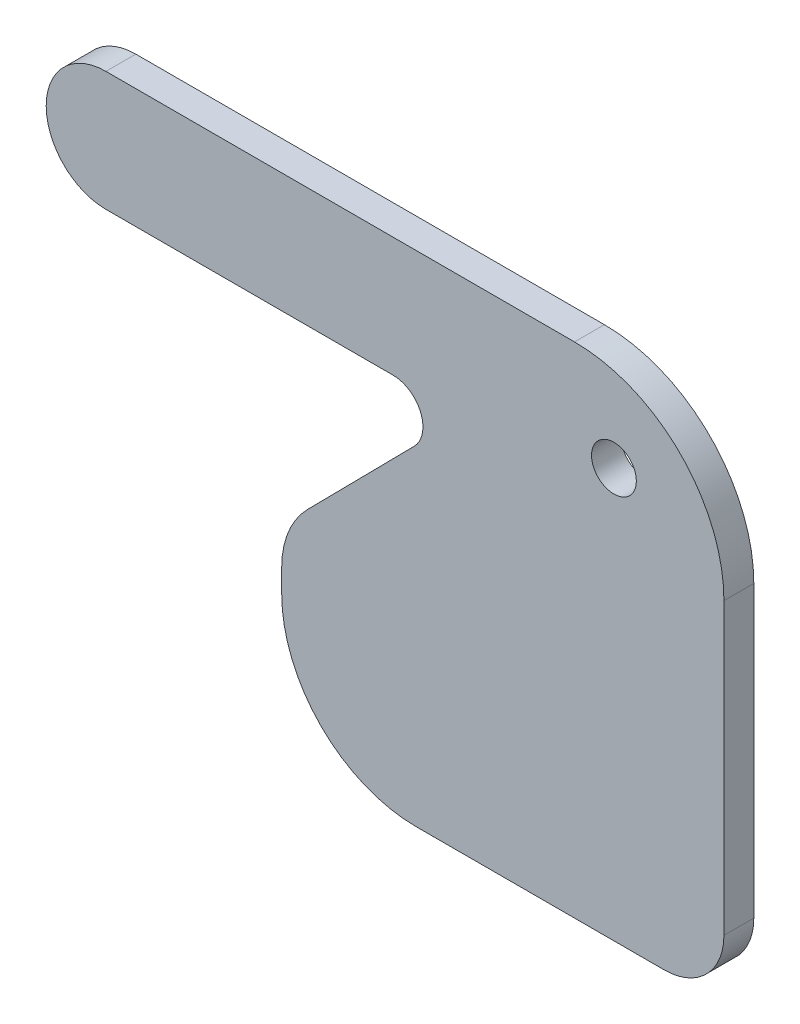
ISO-10303-21;
HEADER;
FILE_DESCRIPTION(('STEP AP214'),'2;1');
FILE_NAME('part.step','',(''),(''),'','','');
FILE_SCHEMA(('AUTOMOTIVE_DESIGN { 1 0 10303 214 1 1 1 1 }'));
ENDSEC;
DATA;
#1=APPLICATION_CONTEXT('core data for automotive mechanical design processes');
#2=APPLICATION_PROTOCOL_DEFINITION('international standard','automotive_design',2000,#1);
#3=PRODUCT_CONTEXT('',#1,'mechanical');
#4=PRODUCT('Part','Part','',(#3));
#5=PRODUCT_RELATED_PRODUCT_CATEGORY('part','',(#4));
#6=PRODUCT_DEFINITION_FORMATION('','',#4);
#7=PRODUCT_DEFINITION_CONTEXT('part definition',#1,'design');
#8=PRODUCT_DEFINITION('design','',#6,#7);
#9=PRODUCT_DEFINITION_SHAPE('','',#8);
#10=(LENGTH_UNIT() NAMED_UNIT(*) SI_UNIT(.MILLI.,.METRE.));
#11=(NAMED_UNIT(*) PLANE_ANGLE_UNIT() SI_UNIT($,.RADIAN.));
#12=(NAMED_UNIT(*) SI_UNIT($,.STERADIAN.) SOLID_ANGLE_UNIT());
#13=UNCERTAINTY_MEASURE_WITH_UNIT(LENGTH_MEASURE(1.E-05),#10,'distance_accuracy_value','');
#14=(GEOMETRIC_REPRESENTATION_CONTEXT(3) GLOBAL_UNCERTAINTY_ASSIGNED_CONTEXT((#13)) GLOBAL_UNIT_ASSIGNED_CONTEXT((#10,
#11,#12)) REPRESENTATION_CONTEXT('',''));
#15=CARTESIAN_POINT('',(0.,0.,0.));
#16=DIRECTION('',(0.,0.,1.));
#17=DIRECTION('',(1.,0.,0.));
#18=AXIS2_PLACEMENT_3D('',#15,#16,#17);
#19=CARTESIAN_POINT('',(-13.1838969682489,-20.,-10.));
#20=DIRECTION('',(0.,0.,1.));
#21=DIRECTION('',(1.,0.,0.));
#22=AXIS2_PLACEMENT_3D('',#19,#20,#21);
#23=CYLINDRICAL_SURFACE('',#22,50.);
#24=CARTESIAN_POINT('',(-13.1838969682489,-20.,0.));
#25=DIRECTION('',(0.,0.,-1.));
#26=DIRECTION('',(-1.,0.,0.));
#27=AXIS2_PLACEMENT_3D('',#24,#25,#26);
#28=CIRCLE('',#27,50.);
#29=CARTESIAN_POINT('',(-13.1838969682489,30.,0.));
#30=VERTEX_POINT('',#29);
#31=CARTESIAN_POINT('',(36.8161030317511,-20.,0.));
#32=VERTEX_POINT('',#31);
#33=EDGE_CURVE('E161',#30,#32,#28,.T.);
#34=ORIENTED_EDGE('',*,*,#33,.T.);
#35=DIRECTION('',(0.,0.,1.));
#36=VECTOR('',#35,1.);
#37=CARTESIAN_POINT('',(36.8161030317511,-20.,-10.));
#38=LINE('',#37,#36);
#39=CARTESIAN_POINT('',(36.8161030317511,-20.,-10.));
#40=VERTEX_POINT('',#39);
#41=EDGE_CURVE('E139',#40,#32,#38,.T.);
#42=ORIENTED_EDGE('',*,*,#41,.F.);
#43=CARTESIAN_POINT('',(-13.1838969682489,-20.,-10.));
#44=DIRECTION('',(0.,0.,-1.));
#45=DIRECTION('',(-1.,0.,0.));
#46=AXIS2_PLACEMENT_3D('',#43,#44,#45);
#47=CIRCLE('',#46,50.);
#48=CARTESIAN_POINT('',(-13.1838969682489,30.,-10.));
#49=VERTEX_POINT('',#48);
#50=EDGE_CURVE('E147',#49,#40,#47,.T.);
#51=ORIENTED_EDGE('',*,*,#50,.F.);
#52=DIRECTION('',(0.,0.,1.));
#53=VECTOR('',#52,1.);
#54=CARTESIAN_POINT('',(-13.1838969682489,30.,-10.));
#55=LINE('',#54,#53);
#56=EDGE_CURVE('E201',#49,#30,#55,.T.);
#57=ORIENTED_EDGE('',*,*,#56,.T.);
#58=EDGE_LOOP('',(#34,#42,#51,#57));
#59=FACE_BOUND('',#58,.T.);
#60=ADVANCED_FACE('F44',(#59),#23,.T.);
#61=CARTESIAN_POINT('',(36.8161030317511,-20.,-10.));
#62=DIRECTION('',(-1.,0.,0.));
#63=DIRECTION('',(0.,-1.,0.));
#64=AXIS2_PLACEMENT_3D('',#61,#62,#63);
#65=PLANE('',#64);
#66=DIRECTION('',(0.,-1.,0.));
#67=VECTOR('',#66,1.);
#68=CARTESIAN_POINT('',(36.8161030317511,-20.,0.));
#69=LINE('',#68,#67);
#70=CARTESIAN_POINT('',(36.8161030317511,-117.,0.));
#71=VERTEX_POINT('',#70);
#72=EDGE_CURVE('E236',#32,#71,#69,.T.);
#73=ORIENTED_EDGE('',*,*,#72,.T.);
#74=DIRECTION('',(0.,0.,1.));
#75=VECTOR('',#74,1.);
#76=CARTESIAN_POINT('',(36.8161030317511,-117.,-10.));
#77=LINE('',#76,#75);
#78=CARTESIAN_POINT('',(36.8161030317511,-117.,-10.));
#79=VERTEX_POINT('',#78);
#80=EDGE_CURVE('E141',#79,#71,#77,.T.);
#81=ORIENTED_EDGE('',*,*,#80,.F.);
#82=DIRECTION('',(0.,-1.,0.));
#83=VECTOR('',#82,1.);
#84=CARTESIAN_POINT('',(36.8161030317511,-20.,-10.));
#85=LINE('',#84,#83);
#86=EDGE_CURVE('E134',#40,#79,#85,.T.);
#87=ORIENTED_EDGE('',*,*,#86,.F.);
#88=ORIENTED_EDGE('',*,*,#41,.T.);
#89=EDGE_LOOP('',(#73,#81,#87,#88));
#90=FACE_BOUND('',#89,.T.);
#91=ADVANCED_FACE('F137',(#90),#65,.F.);
#92=CARTESIAN_POINT('',(16.8161030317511,-117.,-10.));
#93=DIRECTION('',(0.,0.,1.));
#94=DIRECTION('',(1.,0.,0.));
#95=AXIS2_PLACEMENT_3D('',#92,#93,#94);
#96=CYLINDRICAL_SURFACE('',#95,20.);
#97=CARTESIAN_POINT('',(16.8161030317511,-117.,0.));
#98=DIRECTION('',(0.,0.,1.));
#99=DIRECTION('',(1.,0.,0.));
#100=AXIS2_PLACEMENT_3D('',#97,#98,#99);
#101=CIRCLE('',#100,20.);
#102=CARTESIAN_POINT('',(16.8161030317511,-137.,0.));
#103=VERTEX_POINT('',#102);
#104=EDGE_CURVE('E232',#103,#71,#101,.T.);
#105=ORIENTED_EDGE('',*,*,#104,.F.);
#106=DIRECTION('',(0.,0.,1.));
#107=VECTOR('',#106,1.);
#108=CARTESIAN_POINT('',(16.8161030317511,-137.,-10.));
#109=LINE('',#108,#107);
#110=CARTESIAN_POINT('',(16.8161030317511,-137.,-10.));
#111=VERTEX_POINT('',#110);
#112=EDGE_CURVE('E170',#111,#103,#109,.T.);
#113=ORIENTED_EDGE('',*,*,#112,.F.);
#114=CARTESIAN_POINT('',(16.8161030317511,-117.,-10.));
#115=DIRECTION('',(0.,0.,1.));
#116=DIRECTION('',(1.,0.,0.));
#117=AXIS2_PLACEMENT_3D('',#114,#115,#116);
#118=CIRCLE('',#117,20.);
#119=EDGE_CURVE('E146',#111,#79,#118,.T.);
#120=ORIENTED_EDGE('',*,*,#119,.T.);
#121=ORIENTED_EDGE('',*,*,#80,.T.);
#122=EDGE_LOOP('',(#105,#113,#120,#121));
#123=FACE_BOUND('',#122,.T.);
#124=ADVANCED_FACE('F309',(#123),#96,.T.);
#125=CARTESIAN_POINT('',(16.8161030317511,-137.,-10.));
#126=DIRECTION('',(0.,1.,0.));
#127=DIRECTION('',(0.,0.,1.));
#128=AXIS2_PLACEMENT_3D('',#125,#126,#127);
#129=PLANE('',#128);
#130=DIRECTION('',(-1.,0.,0.));
#131=VECTOR('',#130,1.);
#132=CARTESIAN_POINT('',(16.8161030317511,-137.,0.));
#133=LINE('',#132,#131);
#134=CARTESIAN_POINT('',(-66.1838969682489,-137.,0.));
#135=VERTEX_POINT('',#134);
#136=EDGE_CURVE('E229',#103,#135,#133,.T.);
#137=ORIENTED_EDGE('',*,*,#136,.T.);
#138=DIRECTION('',(0.,0.,1.));
#139=VECTOR('',#138,1.);
#140=CARTESIAN_POINT('',(-66.1838969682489,-137.,-10.));
#141=LINE('',#140,#139);
#142=CARTESIAN_POINT('',(-66.1838969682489,-137.,-10.));
#143=VERTEX_POINT('',#142);
#144=EDGE_CURVE('E53',#135,#143,#141,.F.);
#145=ORIENTED_EDGE('',*,*,#144,.T.);
#146=DIRECTION('',(-1.,0.,0.));
#147=VECTOR('',#146,1.);
#148=CARTESIAN_POINT('',(16.8161030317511,-137.,-10.));
#149=LINE('',#148,#147);
#150=EDGE_CURVE('E265',#111,#143,#149,.T.);
#151=ORIENTED_EDGE('',*,*,#150,.F.);
#152=ORIENTED_EDGE('',*,*,#112,.T.);
#153=EDGE_LOOP('',(#137,#145,#151,#152));
#154=FACE_BOUND('',#153,.T.);
#155=ADVANCED_FACE('F314',(#154),#129,.F.);
#156=CARTESIAN_POINT('',(-111.183896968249,-137.,-10.));
#157=DIRECTION('',(1.,0.,0.));
#158=DIRECTION('',(0.,1.,0.));
#159=AXIS2_PLACEMENT_3D('',#156,#157,#158);
#160=PLANE('',#159);
#161=DIRECTION('',(0.,1.,0.));
#162=VECTOR('',#161,1.);
#163=CARTESIAN_POINT('',(-111.183896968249,-137.,-10.));
#164=LINE('',#163,#162);
#165=CARTESIAN_POINT('',(-111.183896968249,-92.,-10.));
#166=VERTEX_POINT('',#165);
#167=CARTESIAN_POINT('',(-111.183896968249,-84.3101412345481,-10.));
#168=VERTEX_POINT('',#167);
#169=EDGE_CURVE('E262',#166,#168,#164,.T.);
#170=ORIENTED_EDGE('',*,*,#169,.F.);
#171=DIRECTION('',(0.,0.,1.));
#172=VECTOR('',#171,1.);
#173=CARTESIAN_POINT('',(-111.183896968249,-92.,-10.));
#174=LINE('',#173,#172);
#175=CARTESIAN_POINT('',(-111.183896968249,-92.,0.));
#176=VERTEX_POINT('',#175);
#177=EDGE_CURVE('E163',#166,#176,#174,.T.);
#178=ORIENTED_EDGE('',*,*,#177,.T.);
#179=DIRECTION('',(0.,1.,0.));
#180=VECTOR('',#179,1.);
#181=CARTESIAN_POINT('',(-111.183896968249,-137.,0.));
#182=LINE('',#181,#180);
#183=CARTESIAN_POINT('',(-111.183896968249,-84.3101412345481,0.));
#184=VERTEX_POINT('',#183);
#185=EDGE_CURVE('E226',#176,#184,#182,.T.);
#186=ORIENTED_EDGE('',*,*,#185,.T.);
#187=DIRECTION('',(0.,0.,1.));
#188=VECTOR('',#187,1.);
#189=CARTESIAN_POINT('',(-111.183896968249,-84.3101412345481,-10.));
#190=LINE('',#189,#188);
#191=EDGE_CURVE('E182',#168,#184,#190,.T.);
#192=ORIENTED_EDGE('',*,*,#191,.F.);
#193=EDGE_LOOP('',(#170,#178,#186,#192));
#194=FACE_BOUND('',#193,.T.);
#195=ADVANCED_FACE('F293',(#194),#160,.F.);
#196=CARTESIAN_POINT('',(-81.1838969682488,-84.3101412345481,-10.));
#197=DIRECTION('',(0.,0.,1.));
#198=DIRECTION('',(1.,0.,0.));
#199=AXIS2_PLACEMENT_3D('',#196,#197,#198);
#200=CYLINDRICAL_SURFACE('',#199,30.);
#201=CARTESIAN_POINT('',(-81.1838969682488,-84.3101412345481,0.));
#202=DIRECTION('',(0.,0.,-1.));
#203=DIRECTION('',(-1.,0.,0.));
#204=AXIS2_PLACEMENT_3D('',#201,#202,#203);
#205=CIRCLE('',#204,30.);
#206=CARTESIAN_POINT('',(-102.537170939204,-63.2379393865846,0.));
#207=VERTEX_POINT('',#206);
#208=EDGE_CURVE('E222',#184,#207,#205,.T.);
#209=ORIENTED_EDGE('',*,*,#208,.T.);
#210=DIRECTION('',(0.,0.,1.));
#211=VECTOR('',#210,1.);
#212=CARTESIAN_POINT('',(-102.537170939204,-63.2379393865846,-10.));
#213=LINE('',#212,#211);
#214=CARTESIAN_POINT('',(-102.537170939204,-63.2379393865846,-10.));
#215=VERTEX_POINT('',#214);
#216=EDGE_CURVE('E186',#215,#207,#213,.T.);
#217=ORIENTED_EDGE('',*,*,#216,.F.);
#218=CARTESIAN_POINT('',(-81.1838969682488,-84.3101412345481,-10.));
#219=DIRECTION('',(0.,0.,-1.));
#220=DIRECTION('',(-1.,0.,0.));
#221=AXIS2_PLACEMENT_3D('',#218,#219,#220);
#222=CIRCLE('',#221,30.);
#223=EDGE_CURVE('E259',#168,#215,#222,.T.);
#224=ORIENTED_EDGE('',*,*,#223,.F.);
#225=ORIENTED_EDGE('',*,*,#191,.T.);
#226=EDGE_LOOP('',(#209,#217,#224,#225));
#227=FACE_BOUND('',#226,.T.);
#228=ADVANCED_FACE('F297',(#227),#200,.T.);
#229=CARTESIAN_POINT('',(-66.7999803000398,-27.0240672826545,-10.));
#230=DIRECTION('',(-0.711775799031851,0.702406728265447,0.));
#231=DIRECTION('',(-0.702406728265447,-0.711775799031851,0.));
#232=AXIS2_PLACEMENT_3D('',#229,#230,#231);
#233=PLANE('',#232);
#234=DIRECTION('',(-0.702406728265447,-0.711775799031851,0.));
#235=VECTOR('',#234,1.);
#236=CARTESIAN_POINT('',(-66.7999803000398,-27.0240672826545,0.));
#237=LINE('',#236,#235);
#238=CARTESIAN_POINT('',(-66.7999803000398,-27.0240672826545,0.));
#239=VERTEX_POINT('',#238);
#240=EDGE_CURVE('E218',#239,#207,#237,.T.);
#241=ORIENTED_EDGE('',*,*,#240,.F.);
#242=DIRECTION('',(0.,0.,1.));
#243=VECTOR('',#242,1.);
#244=CARTESIAN_POINT('',(-66.7999803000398,-27.0240672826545,-10.));
#245=LINE('',#244,#243);
#246=CARTESIAN_POINT('',(-66.7999803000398,-27.0240672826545,-10.));
#247=VERTEX_POINT('',#246);
#248=EDGE_CURVE('E189',#247,#239,#245,.T.);
#249=ORIENTED_EDGE('',*,*,#248,.F.);
#250=DIRECTION('',(-0.702406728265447,-0.711775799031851,0.));
#251=VECTOR('',#250,1.);
#252=CARTESIAN_POINT('',(-66.7999803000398,-27.0240672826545,-10.));
#253=LINE('',#252,#251);
#254=EDGE_CURVE('E255',#247,#215,#253,.T.);
#255=ORIENTED_EDGE('',*,*,#254,.T.);
#256=ORIENTED_EDGE('',*,*,#216,.T.);
#257=EDGE_LOOP('',(#241,#249,#255,#256));
#258=FACE_BOUND('',#257,.T.);
#259=ADVANCED_FACE('F322',(#258),#233,.T.);
#260=CARTESIAN_POINT('',(-73.9177382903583,-20.,-10.));
#261=DIRECTION('',(0.,0.,1.));
#262=DIRECTION('',(1.,0.,0.));
#263=AXIS2_PLACEMENT_3D('',#260,#261,#262);
#264=CYLINDRICAL_SURFACE('',#263,9.99999999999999);
#265=CARTESIAN_POINT('',(-73.9177382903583,-20.,0.));
#266=DIRECTION('',(0.,0.,1.));
#267=DIRECTION('',(1.,0.,0.));
#268=AXIS2_PLACEMENT_3D('',#265,#266,#267);
#269=CIRCLE('',#268,9.99999999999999);
#270=CARTESIAN_POINT('',(-73.9177382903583,-10.,0.));
#271=VERTEX_POINT('',#270);
#272=EDGE_CURVE('E214',#239,#271,#269,.T.);
#273=ORIENTED_EDGE('',*,*,#272,.T.);
#274=DIRECTION('',(0.,0.,1.));
#275=VECTOR('',#274,1.);
#276=CARTESIAN_POINT('',(-73.9177382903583,-10.,-10.));
#277=LINE('',#276,#275);
#278=CARTESIAN_POINT('',(-73.9177382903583,-10.,-10.));
#279=VERTEX_POINT('',#278);
#280=EDGE_CURVE('E192',#279,#271,#277,.T.);
#281=ORIENTED_EDGE('',*,*,#280,.F.);
#282=CARTESIAN_POINT('',(-73.9177382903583,-20.,-10.));
#283=DIRECTION('',(0.,0.,1.));
#284=DIRECTION('',(1.,0.,0.));
#285=AXIS2_PLACEMENT_3D('',#282,#283,#284);
#286=CIRCLE('',#285,9.99999999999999);
#287=EDGE_CURVE('E252',#247,#279,#286,.T.);
#288=ORIENTED_EDGE('',*,*,#287,.F.);
#289=ORIENTED_EDGE('',*,*,#248,.T.);
#290=EDGE_LOOP('',(#273,#281,#288,#289));
#291=FACE_BOUND('',#290,.T.);
#292=ADVANCED_FACE('F325',(#291),#264,.F.);
#293=CARTESIAN_POINT('',(-170.,-10.,-10.));
#294=DIRECTION('',(0.,-1.,0.));
#295=DIRECTION('',(1.,0.,0.));
#296=AXIS2_PLACEMENT_3D('',#293,#294,#295);
#297=PLANE('',#296);
#298=DIRECTION('',(1.,0.,0.));
#299=VECTOR('',#298,1.);
#300=CARTESIAN_POINT('',(-170.,-10.,0.));
#301=LINE('',#300,#299);
#302=CARTESIAN_POINT('',(-170.,-10.,0.));
#303=VERTEX_POINT('',#302);
#304=EDGE_CURVE('E210',#303,#271,#301,.T.);
#305=ORIENTED_EDGE('',*,*,#304,.F.);
#306=DIRECTION('',(0.,0.,1.));
#307=VECTOR('',#306,1.);
#308=CARTESIAN_POINT('',(-170.,-10.,-10.));
#309=LINE('',#308,#307);
#310=CARTESIAN_POINT('',(-170.,-10.,-10.));
#311=VERTEX_POINT('',#310);
#312=EDGE_CURVE('E195',#311,#303,#309,.T.);
#313=ORIENTED_EDGE('',*,*,#312,.F.);
#314=DIRECTION('',(1.,0.,0.));
#315=VECTOR('',#314,1.);
#316=CARTESIAN_POINT('',(-170.,-10.,-10.));
#317=LINE('',#316,#315);
#318=EDGE_CURVE('E248',#311,#279,#317,.T.);
#319=ORIENTED_EDGE('',*,*,#318,.T.);
#320=ORIENTED_EDGE('',*,*,#280,.T.);
#321=EDGE_LOOP('',(#305,#313,#319,#320));
#322=FACE_BOUND('',#321,.T.);
#323=ADVANCED_FACE('F329',(#322),#297,.T.);
#324=CARTESIAN_POINT('',(-170.,10.,-10.));
#325=DIRECTION('',(0.,0.,1.));
#326=DIRECTION('',(1.,0.,0.));
#327=AXIS2_PLACEMENT_3D('',#324,#325,#326);
#328=CYLINDRICAL_SURFACE('',#327,20.);
#329=CARTESIAN_POINT('',(-170.,10.,0.));
#330=DIRECTION('',(0.,0.,1.));
#331=DIRECTION('',(1.,0.,0.));
#332=AXIS2_PLACEMENT_3D('',#329,#330,#331);
#333=CIRCLE('',#332,20.);
#334=CARTESIAN_POINT('',(-170.,30.,0.));
#335=VERTEX_POINT('',#334);
#336=EDGE_CURVE('E206',#335,#303,#333,.T.);
#337=ORIENTED_EDGE('',*,*,#336,.F.);
#338=DIRECTION('',(0.,0.,1.));
#339=VECTOR('',#338,1.);
#340=CARTESIAN_POINT('',(-170.,30.,-10.));
#341=LINE('',#340,#339);
#342=CARTESIAN_POINT('',(-170.,30.,-10.));
#343=VERTEX_POINT('',#342);
#344=EDGE_CURVE('E198',#343,#335,#341,.T.);
#345=ORIENTED_EDGE('',*,*,#344,.F.);
#346=CARTESIAN_POINT('',(-170.,10.,-10.));
#347=DIRECTION('',(0.,0.,1.));
#348=DIRECTION('',(1.,0.,0.));
#349=AXIS2_PLACEMENT_3D('',#346,#347,#348);
#350=CIRCLE('',#349,20.);
#351=EDGE_CURVE('E244',#343,#311,#350,.T.);
#352=ORIENTED_EDGE('',*,*,#351,.T.);
#353=ORIENTED_EDGE('',*,*,#312,.T.);
#354=EDGE_LOOP('',(#337,#345,#352,#353));
#355=FACE_BOUND('',#354,.T.);
#356=ADVANCED_FACE('F333',(#355),#328,.T.);
#357=CARTESIAN_POINT('',(-170.,30.,-10.));
#358=DIRECTION('',(0.,-1.,0.));
#359=DIRECTION('',(0.,0.,-1.));
#360=AXIS2_PLACEMENT_3D('',#357,#358,#359);
#361=PLANE('',#360);
#362=DIRECTION('',(1.,0.,0.));
#363=VECTOR('',#362,1.);
#364=CARTESIAN_POINT('',(-170.,30.,0.));
#365=LINE('',#364,#363);
#366=EDGE_CURVE('E158',#335,#30,#365,.T.);
#367=ORIENTED_EDGE('',*,*,#366,.T.);
#368=ORIENTED_EDGE('',*,*,#56,.F.);
#369=DIRECTION('',(1.,0.,0.));
#370=VECTOR('',#369,1.);
#371=CARTESIAN_POINT('',(-170.,30.,-10.));
#372=LINE('',#371,#370);
#373=EDGE_CURVE('E153',#343,#49,#372,.T.);
#374=ORIENTED_EDGE('',*,*,#373,.F.);
#375=ORIENTED_EDGE('',*,*,#344,.T.);
#376=EDGE_LOOP('',(#367,#368,#374,#375));
#377=FACE_BOUND('',#376,.T.);
#378=ADVANCED_FACE('F337',(#377),#361,.F.);
#379=CARTESIAN_POINT('',(-13.1838969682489,-20.,-10.));
#380=DIRECTION('',(0.,0.,-1.));
#381=DIRECTION('',(-1.,0.,0.));
#382=AXIS2_PLACEMENT_3D('',#379,#380,#381);
#383=PLANE('',#382);
#384=CARTESIAN_POINT('',(0.,0.,-10.));
#385=DIRECTION('',(0.,0.,1.));
#386=DIRECTION('',(1.,0.,0.));
#387=AXIS2_PLACEMENT_3D('',#384,#385,#386);
#388=CIRCLE('',#387,7.5);
#389=CARTESIAN_POINT('',(7.5,0.,-10.));
#390=VERTEX_POINT('',#389);
#391=EDGE_CURVE('E241',#390,#390,#388,.T.);
#392=ORIENTED_EDGE('',*,*,#391,.T.);
#393=EDGE_LOOP('',(#392));
#394=FACE_BOUND('',#393,.T.);
#395=ORIENTED_EDGE('',*,*,#150,.T.);
#396=CARTESIAN_POINT('',(-66.1838969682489,-92.,-10.));
#397=DIRECTION('',(0.,0.,-1.));
#398=DIRECTION('',(-1.,0.,0.));
#399=AXIS2_PLACEMENT_3D('',#396,#397,#398);
#400=CIRCLE('',#399,45.);
#401=EDGE_CURVE('E11',#143,#166,#400,.T.);
#402=ORIENTED_EDGE('',*,*,#401,.T.);
#403=ORIENTED_EDGE('',*,*,#169,.T.);
#404=ORIENTED_EDGE('',*,*,#223,.T.);
#405=ORIENTED_EDGE('',*,*,#254,.F.);
#406=ORIENTED_EDGE('',*,*,#287,.T.);
#407=ORIENTED_EDGE('',*,*,#318,.F.);
#408=ORIENTED_EDGE('',*,*,#351,.F.);
#409=ORIENTED_EDGE('',*,*,#373,.T.);
#410=ORIENTED_EDGE('',*,*,#50,.T.);
#411=ORIENTED_EDGE('',*,*,#86,.T.);
#412=ORIENTED_EDGE('',*,*,#119,.F.);
#413=EDGE_LOOP('',(#395,#402,#403,#404,#405,#406,#407,#408,#409,#410,#411,#412));
#414=FACE_BOUND('',#413,.T.);
#415=ADVANCED_FACE('F150',(#394,#414),#383,.T.);
#416=CARTESIAN_POINT('',(-13.1838969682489,-20.,0.));
#417=DIRECTION('',(0.,0.,-1.));
#418=DIRECTION('',(-1.,0.,0.));
#419=AXIS2_PLACEMENT_3D('',#416,#417,#418);
#420=PLANE('',#419);
#421=CARTESIAN_POINT('',(0.,0.,0.));
#422=DIRECTION('',(0.,0.,1.));
#423=DIRECTION('',(1.,0.,0.));
#424=AXIS2_PLACEMENT_3D('',#421,#422,#423);
#425=CIRCLE('',#424,7.5);
#426=CARTESIAN_POINT('',(7.5,0.,0.));
#427=VERTEX_POINT('',#426);
#428=EDGE_CURVE('E270',#427,#427,#425,.T.);
#429=ORIENTED_EDGE('',*,*,#428,.F.);
#430=EDGE_LOOP('',(#429));
#431=FACE_BOUND('',#430,.T.);
#432=ORIENTED_EDGE('',*,*,#185,.F.);
#433=CARTESIAN_POINT('',(-66.1838969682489,-92.,0.));
#434=DIRECTION('',(0.,0.,-1.));
#435=DIRECTION('',(-1.,0.,0.));
#436=AXIS2_PLACEMENT_3D('',#433,#434,#435);
#437=CIRCLE('',#436,45.);
#438=EDGE_CURVE('E67',#176,#135,#437,.F.);
#439=ORIENTED_EDGE('',*,*,#438,.T.);
#440=ORIENTED_EDGE('',*,*,#136,.F.);
#441=ORIENTED_EDGE('',*,*,#104,.T.);
#442=ORIENTED_EDGE('',*,*,#72,.F.);
#443=ORIENTED_EDGE('',*,*,#33,.F.);
#444=ORIENTED_EDGE('',*,*,#366,.F.);
#445=ORIENTED_EDGE('',*,*,#336,.T.);
#446=ORIENTED_EDGE('',*,*,#304,.T.);
#447=ORIENTED_EDGE('',*,*,#272,.F.);
#448=ORIENTED_EDGE('',*,*,#240,.T.);
#449=ORIENTED_EDGE('',*,*,#208,.F.);
#450=EDGE_LOOP('',(#432,#439,#440,#441,#442,#443,#444,#445,#446,#447,#448,#449));
#451=FACE_BOUND('',#450,.T.);
#452=ADVANCED_FACE('F283',(#431,#451),#420,.F.);
#453=CARTESIAN_POINT('',(0.,0.,-10.));
#454=DIRECTION('',(0.,0.,1.));
#455=DIRECTION('',(1.,0.,0.));
#456=AXIS2_PLACEMENT_3D('',#453,#454,#455);
#457=CYLINDRICAL_SURFACE('',#456,7.5);
#458=ORIENTED_EDGE('',*,*,#391,.F.);
#459=EDGE_LOOP('',(#458));
#460=FACE_BOUND('',#459,.T.);
#461=ORIENTED_EDGE('',*,*,#428,.T.);
#462=EDGE_LOOP('',(#461));
#463=FACE_BOUND('',#462,.T.);
#464=ADVANCED_FACE('F280',(#460,#463),#457,.F.);
#465=CARTESIAN_POINT('',(-66.1838969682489,-92.,-10.));
#466=DIRECTION('',(0.,0.,1.));
#467=DIRECTION('',(1.,0.,0.));
#468=AXIS2_PLACEMENT_3D('',#465,#466,#467);
#469=CYLINDRICAL_SURFACE('',#468,45.);
#470=ORIENTED_EDGE('',*,*,#401,.F.);
#471=ORIENTED_EDGE('',*,*,#144,.F.);
#472=ORIENTED_EDGE('',*,*,#438,.F.);
#473=ORIENTED_EDGE('',*,*,#177,.F.);
#474=EDGE_LOOP('',(#470,#471,#472,#473));
#475=FACE_BOUND('',#474,.T.);
#476=ADVANCED_FACE('F46',(#475),#469,.T.);
#477=CLOSED_SHELL('',(#60,#91,#124,#155,#195,#228,#259,#292,#323,#356,#378,#415,#452,#464,#476));
#478=MANIFOLD_SOLID_BREP('B2',#477);
#479=ADVANCED_BREP_SHAPE_REPRESENTATION('',(#18,#478),#14);
#480=SHAPE_DEFINITION_REPRESENTATION(#9,#479);
ENDSEC;
END-ISO-10303-21;
